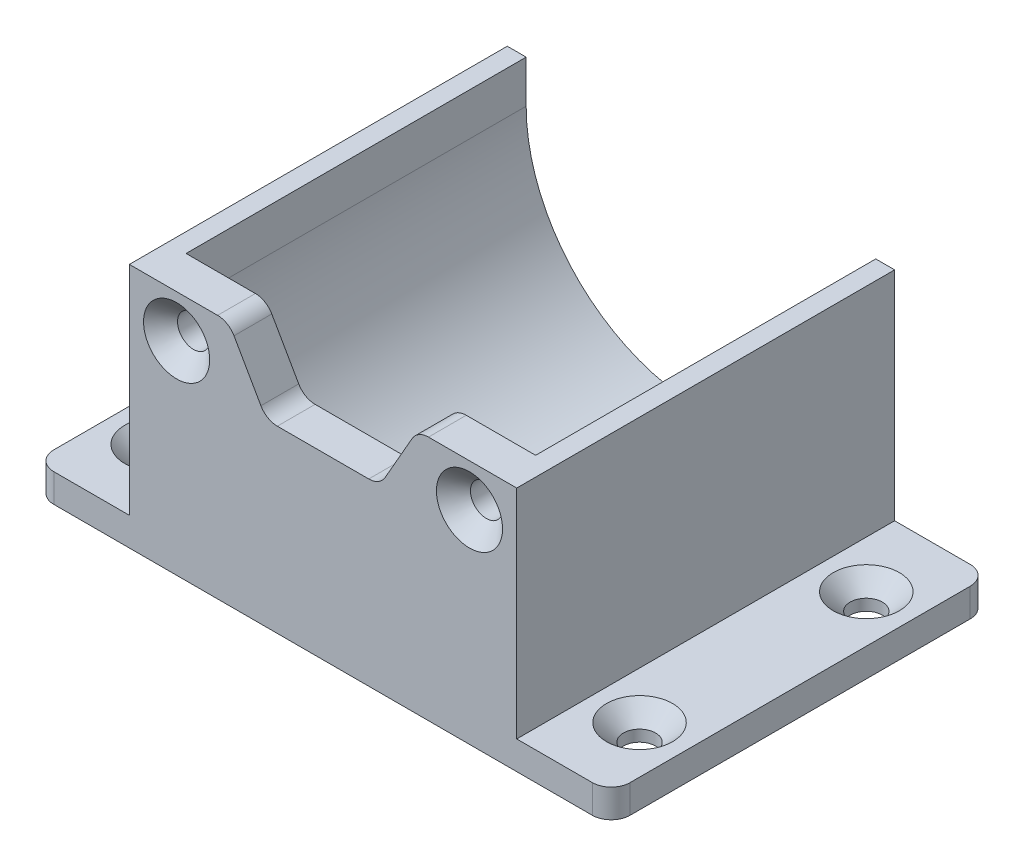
from build123d import *

# Parameters (mm, degrees)
SCHIZZO1_W                   = 41
SCHIZZO1_H                   = 26
ESTRUSIONE_ESTRUSIONE1_DEPTH = 40
SCHIZZO2_R                   = 18.5
TAGLIO_ESTRUSIONE1_DEPTH     = 36
SCHIZZO3_R                   = 1.7
TAGLIO_ESTRUSIONE2_DEPTH     = 36
SMUSSO1_SIZE                 = 1.8
TAGLIO_ESTRUSIONE3_DEPTH     = 47.789421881
RACCORDO1_R                  = 2
TAGLIO_ESTRUSIONE4_DEPTH     = 36
SCHIZZO6_W                   = 10
SCHIZZO6_H                   = 40
ESTRUSIONE_ESTRUSIONE2_DEPTH = 3
RACCORDO2_R                  = 2
SCHIZZO7_R                   = 1.7
TAGLIO_ESTRUSIONE5_DEPTH     = 56.310487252
SMUSSO2_SIZE                 = 1.8


with BuildPart() as part:
    # Schizzo1 → Estrusione-Estrusione1 (new body)
    with BuildSketch(Plane.XY):
        Rectangle(SCHIZZO1_W, SCHIZZO1_H)
    extrude(amount=ESTRUSIONE_ESTRUSIONE1_DEPTH)

    # Schizzo2 → Taglio-Estrusione1 (cut)
    with BuildSketch(Plane(origin=(0, 0, 0), x_dir=(-1, 0, 0), z_dir=(0, 0, -1))):
        with Locations((0, 8.5)):
            Circle(SCHIZZO2_R)
    extrude(amount=-TAGLIO_ESTRUSIONE1_DEPTH, mode=Mode.SUBTRACT)

    # Schizzo3 → Taglio-Estrusione2 (cut)
    with BuildSketch(Plane.XY.offset(40)):
        with Locations((-15.5, 8.5)):
            Circle(SCHIZZO3_R)
        with Locations(Location((15.5, 8.5, 0), (0, 0, 180))):
            Circle(SCHIZZO3_R)
    extrude(amount=-TAGLIO_ESTRUSIONE2_DEPTH, mode=Mode.SUBTRACT)

    # Smusso1
    smusso1_edges = [part.edges().sort_by_distance(p)[0] for p in [
        (-17.2, 8.5, 40),
        (17.2, 8.5, 40),
    ]]
    chamfer(smusso1_edges, length=SMUSSO1_SIZE)

    # Schizzo4 → Taglio-Estrusione3 (cut, through all)
    with BuildSketch(Plane.XY.offset(40)):
        Polygon((10, 13), (-10, 13), (-6, 6), (6, 6), align=None)
    extrude(amount=-TAGLIO_ESTRUSIONE3_DEPTH, mode=Mode.SUBTRACT)

    # Raccordo1
    raccordo1_edges = [part.edges().sort_by_distance(p)[0] for p in [
        (-6, 6, 38),
        (-10, 13, 38),
        (10, 13, 38),
        (6, 6, 38),
    ]]
    fillet(raccordo1_edges, radius=RACCORDO1_R)

    # Schizzo5 → Taglio-Estrusione4 (cut)
    with BuildSketch(Plane(origin=(0, 0, 0), x_dir=(-1, 0, 0), z_dir=(0, 0, -1))):
        with BuildLine():
            Line((-18.5, 8.5), (-18.5, 13))
            Line((-18.5, 13), (-17.944358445, 13))
            ThreePointArc((-17.944358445, 13), (-18.360564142, 10.767087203), (-18.5, 8.5))
        make_face()
        with BuildLine():
            Line((18.5, 13), (17.944358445, 13))
            ThreePointArc((17.944358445, 13), (18.360564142, 10.767087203), (18.5, 8.5))
            Line((18.5, 8.5), (18.5, 13))
        make_face()
    extrude(amount=-TAGLIO_ESTRUSIONE4_DEPTH, mode=Mode.SUBTRACT)

    # Schizzo6 → Estrusione-Estrusione2 (add)
    with BuildSketch(Plane.XZ.offset(13)):
        with Locations((-25.5, 20)):
            Rectangle(SCHIZZO6_W, SCHIZZO6_H)
        with Locations((25.5, 20)):
            Rectangle(SCHIZZO6_W, SCHIZZO6_H)
    extrude(amount=-ESTRUSIONE_ESTRUSIONE2_DEPTH)

    # Raccordo2
    raccordo2_edges = [part.edges().sort_by_distance(p)[0] for p in [
        (-30.5, -11.5, 0),
        (-30.5, -11.5, 40),
        (30.5, -11.5, 40),
        (30.5, -11.5, 0),
    ]]
    fillet(raccordo2_edges, radius=RACCORDO2_R)

    # Schizzo7 → Taglio-Estrusione5 (cut, through all)
    with BuildSketch(Plane(origin=(0, -10, 0), x_dir=(1, 0, 0), z_dir=(0, 1, 0))):
        with Locations(Location((-25.5, -8, 0), (0, 0, 270))):
            Circle(SCHIZZO7_R)
        with Locations(Location((-25.5, -32, 0), (0, 0, 90))):
            Circle(SCHIZZO7_R)
        with Locations(Location((25.5, -32, 0), (0, 0, 270))):
            Circle(SCHIZZO7_R)
        with Locations(Location((25.5, -8, 0), (0, 0, 90))):
            Circle(SCHIZZO7_R)
    extrude(amount=-TAGLIO_ESTRUSIONE5_DEPTH, mode=Mode.SUBTRACT)

    # Smusso2
    smusso2_edges = [part.edges().sort_by_distance(p)[0] for p in [
        (-25.5, -10, 6.3),
        (-25.5, -10, 33.7),
        (25.5, -10, 30.3),
        (25.5, -10, 9.7),
    ]]
    chamfer(smusso2_edges, length=SMUSSO2_SIZE)


solid = part.part
